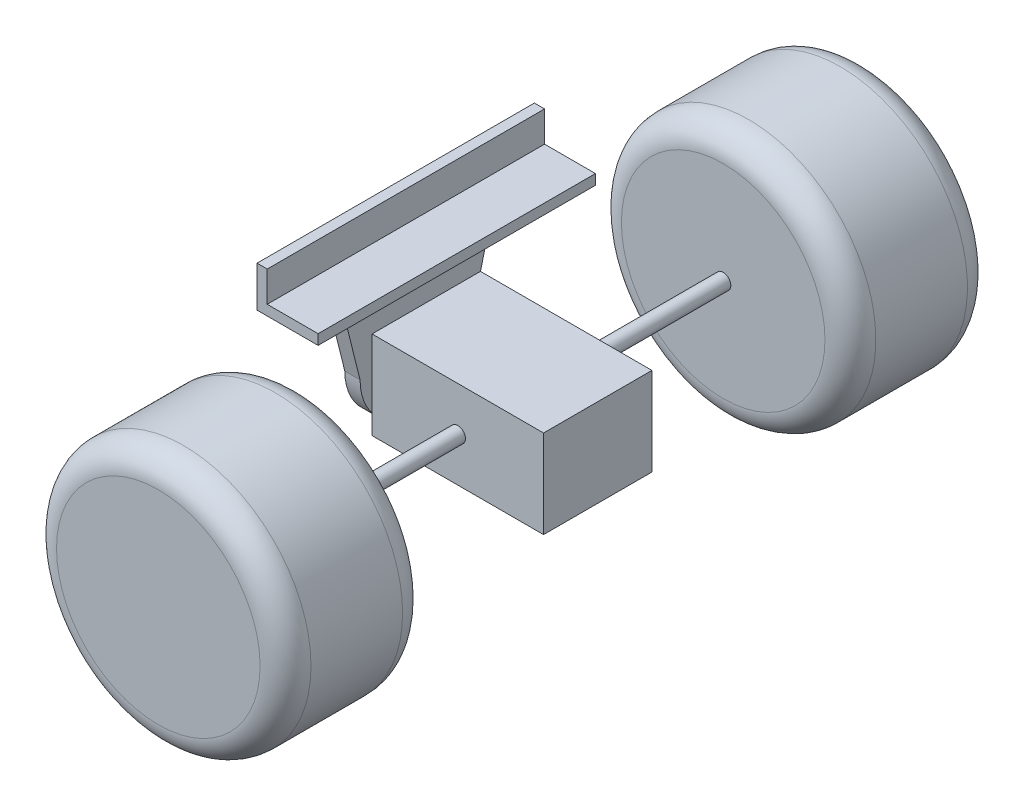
from build123d import *

# Parameters (mm, degrees)
SKETCH1_R            = 1.5
BOSS_EXTRUDE1_DEPTH  = 41.5
SKETCH2_R            = 25
BOSS_EXTRUDE2_DEPTH  = 28
FILLET1_R            = 5
FILLET1_OF_MIRROR2_R = 5
SKETCH3_W            = 33.7
SKETCH3_H            = 17.3
BOSS_EXTRUDE3_DEPTH  = 10.65
SKETCH4_R            = 5
BOSS_EXTRUDE4_DEPTH  = 2
BOSS_EXTRUDE5_DEPTH  = 3
BOSS_EXTRUDE6_DEPTH  = 27.25


with BuildPart() as part:
    # Sketch1 → Boss-Extrude1 (new, symmetric)
    with BuildSketch(Plane.XY):
        Circle(SKETCH1_R)
    extrude(amount=BOSS_EXTRUDE1_DEPTH, both=True)

    # Sketch2 → Boss-Extrude2 (add)
    with BuildSketch(Plane.XY.offset(41.5)):
        Circle(SKETCH2_R)
    boss_extrude2 = extrude(amount=BOSS_EXTRUDE2_DEPTH)

    # Fillet1
    fillet1_edges = [part.edges().sort_by_distance(p)[0] for p in [
        (-25, 0, 41.5),
        (-25, 0, 69.5),
    ]]
    fillet(fillet1_edges, radius=FILLET1_R)

    # Mirror2: Boss-Extrude2 across plane
    add(boss_extrude2.mirror(Plane.XY))

    # Fillet1 of Mirror2
    fillet1_of_mirror2_edges = [part.edges().sort_by_distance(p)[0] for p in [
        (-25, 0, -41.5),
        (-25, 0, -69.5),
    ]]
    fillet(fillet1_of_mirror2_edges, radius=FILLET1_OF_MIRROR2_R)

    # Sketch3 → Boss-Extrude3 (add, symmetric)
    with BuildSketch(Plane.XY):
        Rectangle(SKETCH3_W, SKETCH3_H)
    extrude(amount=BOSS_EXTRUDE3_DEPTH, both=True)

    # Sketch4 → Boss-Extrude4 (add)
    with BuildSketch(Plane.ZY.offset(16.85)):
        Circle(SKETCH4_R)
    extrude(amount=BOSS_EXTRUDE4_DEPTH)

    # Sketch5 → Boss-Extrude5 (add)
    with BuildSketch(Plane.ZY.offset(18.85)):
        with BuildLine():
            Line((15.5, 18), (-15.5, 18))
            Line((-15.5, 18), (-11, 0))
            ThreePointArc((-11, 0), (0, -11), (11, 0))
            Line((11, 0), (15.5, 18))
        make_face()
    extrude(amount=BOSS_EXTRUDE5_DEPTH)

    # Sketch7 → Boss-Extrude6 (add, symmetric)
    with BuildSketch(Plane.XY):
        Polygon((-20.85, 18), (-22.85, 18), (-22.85, 26), (-20.85, 26), (-20.85, 20), (-10.85, 20), (-10.85, 18), align=None)
    extrude(amount=BOSS_EXTRUDE6_DEPTH, both=True)


solid = part.part
